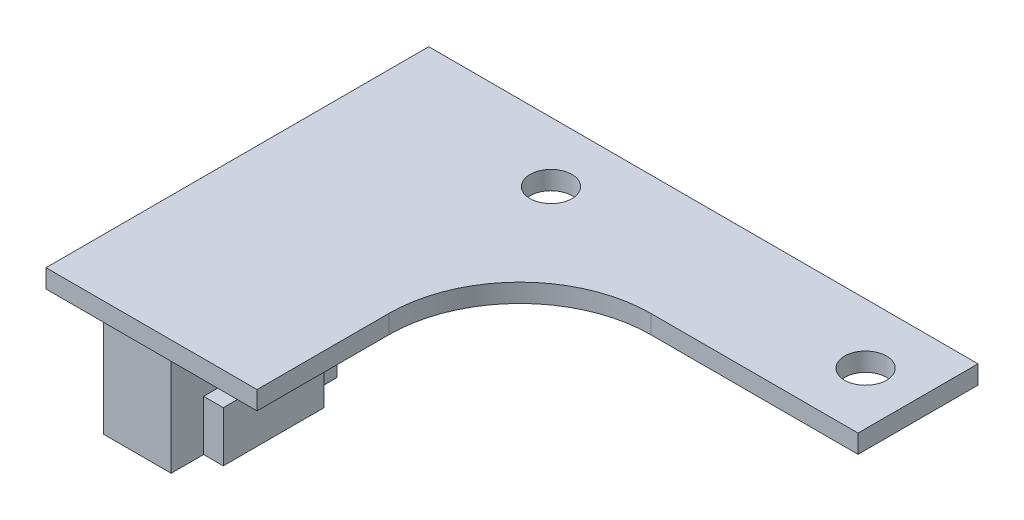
from build123d import *

# Parameters (mm, degrees)
SKETCH1_R           = 1.6
BOSS_EXTRUDE1_DEPTH = 1.41
SKETCH2_W           = 5.15
SKETCH2_H           = 12.65
BOSS_EXTRUDE2_DEPTH = 11.8
SKETCH3_W           = 7.7
SKETCH3_H           = 3.85
BOSS_EXTRUDE3_DEPTH = 1.5


with BuildPart() as part:
    # Sketch1 → Boss-Extrude1 (new body)
    with BuildSketch(Plane(origin=(0, 0, 0), x_dir=(1, 0, 0), z_dir=(0, 1, 0))):
        with BuildLine():
            Line((28, 4.575), (28, -4.575))
            Line((28, -4.575), (12.2, -4.575))
            ThreePointArc((12.2, -4.575), (5.128932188, -7.503932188), (2.2, -14.575))
            Line((2.2, -14.575), (2.2, -24.625))
            Line((2.2, -24.625), (-13.9, -24.625))
            Line((-13.9, -24.625), (-13.9, 4.575))
            Line((-13.9, 4.575), (28, 4.575))
        make_face()
        with Locations(Location((0, 0, 0), (0, 0, 270))):
            Circle(SKETCH1_R, mode=Mode.SUBTRACT)
        with Locations(Location((24, 0, 0), (0, 0, 270))):
            Circle(SKETCH1_R, mode=Mode.SUBTRACT)
    extrude(amount=BOSS_EXTRUDE1_DEPTH)

    # Sketch2 → Boss-Extrude2 (add)
    with BuildSketch(Plane.XZ):
        with Locations((-11.325, 13.9)):
            Rectangle(SKETCH2_W, SKETCH2_H)
    extrude(amount=BOSS_EXTRUDE2_DEPTH)

    # Sketch3 → Boss-Extrude3 (add)
    with BuildSketch(Plane(origin=(-8.75, 0, 0), x_dir=(0, 0, -1), z_dir=(1, 0, 0))):
        with Locations((-13.9, -9.875)):
            Rectangle(SKETCH3_W, SKETCH3_H)
    extrude(amount=BOSS_EXTRUDE3_DEPTH)


solid = part.part
